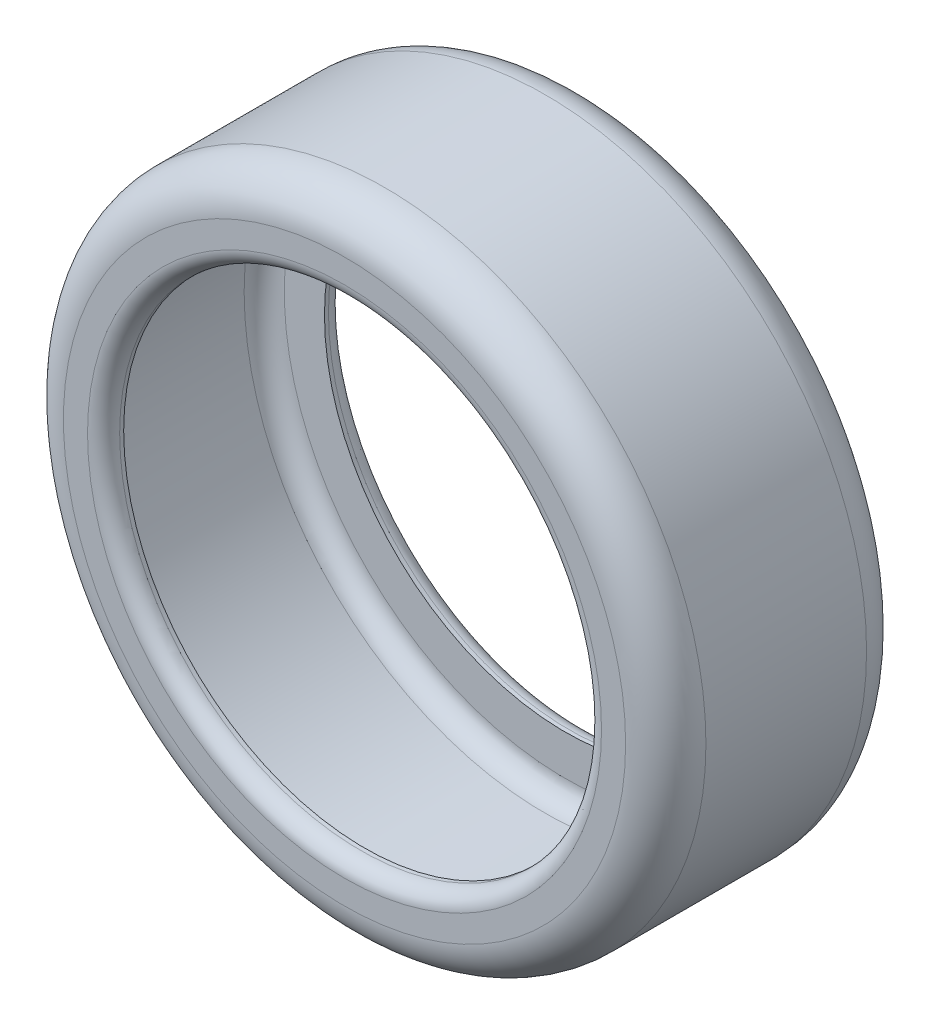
ISO-10303-21;
HEADER;
FILE_DESCRIPTION(('STEP AP214'),'2;1');
FILE_NAME('part.step','',(''),(''),'','','');
FILE_SCHEMA(('AUTOMOTIVE_DESIGN { 1 0 10303 214 1 1 1 1 }'));
ENDSEC;
DATA;
#1=APPLICATION_CONTEXT('core data for automotive mechanical design processes');
#2=APPLICATION_PROTOCOL_DEFINITION('international standard','automotive_design',2000,#1);
#3=PRODUCT_CONTEXT('',#1,'mechanical');
#4=PRODUCT('Part','Part','',(#3));
#5=PRODUCT_RELATED_PRODUCT_CATEGORY('part','',(#4));
#6=PRODUCT_DEFINITION_FORMATION('','',#4);
#7=PRODUCT_DEFINITION_CONTEXT('part definition',#1,'design');
#8=PRODUCT_DEFINITION('design','',#6,#7);
#9=PRODUCT_DEFINITION_SHAPE('','',#8);
#10=(LENGTH_UNIT() NAMED_UNIT(*) SI_UNIT(.MILLI.,.METRE.));
#11=(NAMED_UNIT(*) PLANE_ANGLE_UNIT() SI_UNIT($,.RADIAN.));
#12=(NAMED_UNIT(*) SI_UNIT($,.STERADIAN.) SOLID_ANGLE_UNIT());
#13=UNCERTAINTY_MEASURE_WITH_UNIT(LENGTH_MEASURE(1.E-05),#10,'distance_accuracy_value','');
#14=(GEOMETRIC_REPRESENTATION_CONTEXT(3) GLOBAL_UNCERTAINTY_ASSIGNED_CONTEXT((#13)) GLOBAL_UNIT_ASSIGNED_CONTEXT((#10,
#11,#12)) REPRESENTATION_CONTEXT('',''));
#15=CARTESIAN_POINT('',(0.,0.,0.));
#16=DIRECTION('',(0.,0.,1.));
#17=DIRECTION('',(1.,0.,0.));
#18=AXIS2_PLACEMENT_3D('',#15,#16,#17);
#19=CARTESIAN_POINT('',(0.,0.,76.2));
#20=DIRECTION('',(0.,0.,-1.));
#21=DIRECTION('',(-1.,0.,0.));
#22=AXIS2_PLACEMENT_3D('',#19,#20,#21);
#23=CYLINDRICAL_SURFACE('',#22,76.2);
#24=CARTESIAN_POINT('',(0.,0.,71.12));
#25=DIRECTION('',(0.,0.,1.));
#26=DIRECTION('',(1.,0.,0.));
#27=AXIS2_PLACEMENT_3D('',#24,#25,#26);
#28=CIRCLE('',#27,76.2);
#29=CARTESIAN_POINT('',(-76.2,0.,71.12));
#30=VERTEX_POINT('',#29);
#31=EDGE_CURVE('E62',#30,#30,#28,.T.);
#32=CARTESIAN_POINT('',(0.,0.,69.85));
#33=DIRECTION('',(0.,0.,1.));
#34=DIRECTION('',(1.,0.,0.));
#35=AXIS2_PLACEMENT_3D('',#32,#33,#34);
#36=CIRCLE('',#35,76.2);
#37=CARTESIAN_POINT('',(-76.2,0.,69.85));
#38=VERTEX_POINT('',#37);
#39=EDGE_CURVE('E86',#38,#38,#36,.F.);
#40=CARTESIAN_POINT('',(-76.2,0.,71.12));
#41=CARTESIAN_POINT('',(-76.2,0.,71.1067708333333));
#42=CARTESIAN_POINT('',(-76.2,0.,71.0935416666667));
#43=CARTESIAN_POINT('',(-76.2,0.,71.0670833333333));
#44=CARTESIAN_POINT('',(-76.2,0.,71.0538541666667));
#45=CARTESIAN_POINT('',(-76.2,0.,71.0273958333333));
#46=CARTESIAN_POINT('',(-76.2,0.,71.0141666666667));
#47=CARTESIAN_POINT('',(-76.2,0.,70.9877083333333));
#48=CARTESIAN_POINT('',(-76.2,0.,70.9744791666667));
#49=CARTESIAN_POINT('',(-76.2,0.,70.9480208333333));
#50=CARTESIAN_POINT('',(-76.2,0.,70.9347916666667));
#51=CARTESIAN_POINT('',(-76.2,0.,70.9083333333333));
#52=CARTESIAN_POINT('',(-76.2,0.,70.8951041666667));
#53=CARTESIAN_POINT('',(-76.2,0.,70.8686458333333));
#54=CARTESIAN_POINT('',(-76.2,0.,70.8554166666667));
#55=CARTESIAN_POINT('',(-76.2,0.,70.8289583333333));
#56=CARTESIAN_POINT('',(-76.2,0.,70.8157291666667));
#57=CARTESIAN_POINT('',(-76.2,0.,70.7892708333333));
#58=CARTESIAN_POINT('',(-76.2,0.,70.7760416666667));
#59=CARTESIAN_POINT('',(-76.2,0.,70.7495833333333));
#60=CARTESIAN_POINT('',(-76.2,0.,70.7363541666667));
#61=CARTESIAN_POINT('',(-76.2,0.,70.7098958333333));
#62=CARTESIAN_POINT('',(-76.2,0.,70.6966666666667));
#63=CARTESIAN_POINT('',(-76.2,0.,70.6702083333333));
#64=CARTESIAN_POINT('',(-76.2,0.,70.6569791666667));
#65=CARTESIAN_POINT('',(-76.2,0.,70.6305208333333));
#66=CARTESIAN_POINT('',(-76.2,0.,70.6172916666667));
#67=CARTESIAN_POINT('',(-76.2,0.,70.5908333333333));
#68=CARTESIAN_POINT('',(-76.2,0.,70.5776041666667));
#69=CARTESIAN_POINT('',(-76.2,0.,70.5511458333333));
#70=CARTESIAN_POINT('',(-76.2,0.,70.5379166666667));
#71=CARTESIAN_POINT('',(-76.2,0.,70.5114583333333));
#72=CARTESIAN_POINT('',(-76.2,0.,70.4982291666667));
#73=CARTESIAN_POINT('',(-76.2,0.,70.4717708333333));
#74=CARTESIAN_POINT('',(-76.2,0.,70.4585416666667));
#75=CARTESIAN_POINT('',(-76.2,0.,70.4320833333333));
#76=CARTESIAN_POINT('',(-76.2,0.,70.4188541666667));
#77=CARTESIAN_POINT('',(-76.2,0.,70.3923958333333));
#78=CARTESIAN_POINT('',(-76.2,0.,70.3791666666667));
#79=CARTESIAN_POINT('',(-76.2,0.,70.3527083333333));
#80=CARTESIAN_POINT('',(-76.2,0.,70.3394791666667));
#81=CARTESIAN_POINT('',(-76.2,0.,70.3130208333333));
#82=CARTESIAN_POINT('',(-76.2,0.,70.2997916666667));
#83=CARTESIAN_POINT('',(-76.2,0.,70.2733333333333));
#84=CARTESIAN_POINT('',(-76.2,0.,70.2601041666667));
#85=CARTESIAN_POINT('',(-76.2,0.,70.2336458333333));
#86=CARTESIAN_POINT('',(-76.2,0.,70.2204166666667));
#87=CARTESIAN_POINT('',(-76.2,0.,70.1939583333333));
#88=CARTESIAN_POINT('',(-76.2,0.,70.1807291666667));
#89=CARTESIAN_POINT('',(-76.2,0.,70.1542708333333));
#90=CARTESIAN_POINT('',(-76.2,0.,70.1410416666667));
#91=CARTESIAN_POINT('',(-76.2,0.,70.1145833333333));
#92=CARTESIAN_POINT('',(-76.2,0.,70.1013541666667));
#93=CARTESIAN_POINT('',(-76.2,0.,70.0748958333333));
#94=CARTESIAN_POINT('',(-76.2,0.,70.0616666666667));
#95=CARTESIAN_POINT('',(-76.2,0.,70.0352083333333));
#96=CARTESIAN_POINT('',(-76.2,0.,70.0219791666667));
#97=CARTESIAN_POINT('',(-76.2,0.,69.9955208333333));
#98=CARTESIAN_POINT('',(-76.2,0.,69.9822916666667));
#99=CARTESIAN_POINT('',(-76.2,0.,69.9558333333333));
#100=CARTESIAN_POINT('',(-76.2,0.,69.9426041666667));
#101=CARTESIAN_POINT('',(-76.2,0.,69.9161458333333));
#102=CARTESIAN_POINT('',(-76.2,0.,69.9029166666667));
#103=CARTESIAN_POINT('',(-76.2,0.,69.8764583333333));
#104=CARTESIAN_POINT('',(-76.2,0.,69.8632291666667));
#105=CARTESIAN_POINT('',(-76.2,0.,69.85));
#106=B_SPLINE_CURVE_WITH_KNOTS('',3,(#40,#41,#42,#43,#44,#45,#46,#47,#48,#49,#50,#51,#52,#53,
#54,#55,#56,#57,#58,#59,#60,#61,#62,#63,#64,#65,#66,#67,#68,#69,#70,#71,#72,#73,#74,#75,#76,#77,
#78,#79,#80,#81,#82,#83,#84,#85,#86,#87,#88,#89,#90,#91,#92,#93,#94,#95,#96,#97,#98,#99,#100,
#101,#102,#103,#104,#105),.UNSPECIFIED.,.F.,.F.,(4,2,2,2,2,2,2,2,2,2,2,2,2,2,2,2,2,2,2,2,2,2,2,
2,2,2,2,2,2,2,2,2,4),(0.,0.0396875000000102,0.0793750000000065,0.119062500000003,
0.158749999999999,0.198437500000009,0.238125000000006,0.277812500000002,0.317499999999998,
0.357187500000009,0.396875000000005,0.436562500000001,0.476249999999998,0.515937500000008,
0.555625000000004,0.5953125,0.634999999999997,0.674687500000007,0.714375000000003,0.7540625,
0.793749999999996,0.833437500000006,0.873125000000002,0.912812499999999,0.952499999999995,
0.992187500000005,1.031875,1.0715625,1.11124999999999,1.1509375,1.190625,1.2303125,
1.26999999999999),.UNSPECIFIED.);
#107=EDGE_CURVE('BSEAM51',#30,#38,#106,.T.);
#108=ORIENTED_EDGE('',*,*,#31,.T.);
#109=ORIENTED_EDGE('',*,*,#39,.T.);
#110=ORIENTED_EDGE('',*,*,#107,.T.);
#111=ORIENTED_EDGE('',*,*,#107,.F.);
#112=EDGE_LOOP('',(#108,#110,#109,#111));
#113=FACE_BOUND('',#112,.T.);
#114=ADVANCED_FACE('F51',(#113),#23,.F.);
#115=CARTESIAN_POINT('',(0.,0.,76.2));
#116=DIRECTION('',(0.,0.,1.));
#117=DIRECTION('',(1.,0.,0.));
#118=AXIS2_PLACEMENT_3D('',#115,#116,#117);
#119=PLANE('',#118);
#120=CARTESIAN_POINT('',(0.,0.,76.2));
#121=DIRECTION('',(0.,0.,1.));
#122=DIRECTION('',(1.,0.,0.));
#123=AXIS2_PLACEMENT_3D('',#120,#121,#122);
#124=CIRCLE('',#123,81.28);
#125=CARTESIAN_POINT('',(81.28,0.,76.2));
#126=VERTEX_POINT('',#125);
#127=EDGE_CURVE('E10',#126,#126,#124,.F.);
#128=ORIENTED_EDGE('',*,*,#127,.T.);
#129=EDGE_LOOP('',(#128));
#130=FACE_BOUND('',#129,.T.);
#131=CARTESIAN_POINT('',(0.,0.,76.2));
#132=DIRECTION('',(0.,0.,1.));
#133=DIRECTION('',(1.,0.,0.));
#134=AXIS2_PLACEMENT_3D('',#131,#132,#133);
#135=CIRCLE('',#134,88.9);
#136=CARTESIAN_POINT('',(88.9,0.,76.2));
#137=VERTEX_POINT('',#136);
#138=EDGE_CURVE('E71',#137,#137,#135,.T.);
#139=ORIENTED_EDGE('',*,*,#138,.T.);
#140=EDGE_LOOP('',(#139));
#141=FACE_BOUND('',#140,.T.);
#142=ADVANCED_FACE('F112',(#130,#141),#119,.T.);
#143=CARTESIAN_POINT('',(0.,0.,0.));
#144=DIRECTION('',(0.,0.,1.));
#145=DIRECTION('',(1.,0.,0.));
#146=AXIS2_PLACEMENT_3D('',#143,#144,#145);
#147=PLANE('',#146);
#148=CARTESIAN_POINT('',(0.,0.,0.));
#149=DIRECTION('',(0.,0.,1.));
#150=DIRECTION('',(1.,0.,0.));
#151=AXIS2_PLACEMENT_3D('',#148,#149,#150);
#152=CIRCLE('',#151,81.28);
#153=CARTESIAN_POINT('',(81.28,0.,0.));
#154=VERTEX_POINT('',#153);
#155=EDGE_CURVE('E66',#154,#154,#152,.T.);
#156=ORIENTED_EDGE('',*,*,#155,.T.);
#157=EDGE_LOOP('',(#156));
#158=FACE_BOUND('',#157,.T.);
#159=CARTESIAN_POINT('',(0.,0.,0.));
#160=DIRECTION('',(0.,0.,1.));
#161=DIRECTION('',(1.,0.,0.));
#162=AXIS2_PLACEMENT_3D('',#159,#160,#161);
#163=CIRCLE('',#162,88.9);
#164=CARTESIAN_POINT('',(88.9,0.,0.));
#165=VERTEX_POINT('',#164);
#166=EDGE_CURVE('E74',#165,#165,#163,.F.);
#167=ORIENTED_EDGE('',*,*,#166,.T.);
#168=EDGE_LOOP('',(#167));
#169=FACE_BOUND('',#168,.T.);
#170=ADVANCED_FACE('F121',(#158,#169),#147,.F.);
#171=CARTESIAN_POINT('',(0.,0.,76.2));
#172=DIRECTION('',(0.,0.,-1.));
#173=DIRECTION('',(-1.,0.,0.));
#174=AXIS2_PLACEMENT_3D('',#171,#172,#173);
#175=CYLINDRICAL_SURFACE('',#174,101.6);
#176=CARTESIAN_POINT('',(0.,0.,12.7));
#177=DIRECTION('',(0.,0.,1.));
#178=DIRECTION('',(1.,0.,0.));
#179=AXIS2_PLACEMENT_3D('',#176,#177,#178);
#180=CIRCLE('',#179,101.6);
#181=CARTESIAN_POINT('',(-101.6,0.,12.7));
#182=VERTEX_POINT('',#181);
#183=EDGE_CURVE('E77',#182,#182,#180,.T.);
#184=CARTESIAN_POINT('',(0.,0.,63.5));
#185=DIRECTION('',(0.,0.,1.));
#186=DIRECTION('',(1.,0.,0.));
#187=AXIS2_PLACEMENT_3D('',#184,#185,#186);
#188=CIRCLE('',#187,101.6);
#189=CARTESIAN_POINT('',(-101.6,0.,63.5));
#190=VERTEX_POINT('',#189);
#191=EDGE_CURVE('E80',#190,#190,#188,.F.);
#192=CARTESIAN_POINT('',(-101.6,0.,12.7));
#193=CARTESIAN_POINT('',(-101.6,0.,13.2291666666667));
#194=CARTESIAN_POINT('',(-101.6,0.,13.7583333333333));
#195=CARTESIAN_POINT('',(-101.6,0.,14.8166666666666));
#196=CARTESIAN_POINT('',(-101.6,0.,15.3458333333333));
#197=CARTESIAN_POINT('',(-101.6,0.,16.4041666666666));
#198=CARTESIAN_POINT('',(-101.6,0.,16.9333333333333));
#199=CARTESIAN_POINT('',(-101.6,0.,17.9916666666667));
#200=CARTESIAN_POINT('',(-101.6,0.,18.5208333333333));
#201=CARTESIAN_POINT('',(-101.6,0.,19.5791666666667));
#202=CARTESIAN_POINT('',(-101.6,0.,20.1083333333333));
#203=CARTESIAN_POINT('',(-101.6,0.,21.1666666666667));
#204=CARTESIAN_POINT('',(-101.6,0.,21.6958333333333));
#205=CARTESIAN_POINT('',(-101.6,0.,22.7541666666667));
#206=CARTESIAN_POINT('',(-101.6,0.,23.2833333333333));
#207=CARTESIAN_POINT('',(-101.6,0.,24.3416666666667));
#208=CARTESIAN_POINT('',(-101.6,0.,24.8708333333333));
#209=CARTESIAN_POINT('',(-101.6,0.,25.9291666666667));
#210=CARTESIAN_POINT('',(-101.6,0.,26.4583333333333));
#211=CARTESIAN_POINT('',(-101.6,0.,27.5166666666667));
#212=CARTESIAN_POINT('',(-101.6,0.,28.0458333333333));
#213=CARTESIAN_POINT('',(-101.6,0.,29.1041666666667));
#214=CARTESIAN_POINT('',(-101.6,0.,29.6333333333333));
#215=CARTESIAN_POINT('',(-101.6,0.,30.6916666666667));
#216=CARTESIAN_POINT('',(-101.6,0.,31.2208333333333));
#217=CARTESIAN_POINT('',(-101.6,0.,32.2791666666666));
#218=CARTESIAN_POINT('',(-101.6,0.,32.8083333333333));
#219=CARTESIAN_POINT('',(-101.6,0.,33.8666666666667));
#220=CARTESIAN_POINT('',(-101.6,0.,34.3958333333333));
#221=CARTESIAN_POINT('',(-101.6,0.,35.4541666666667));
#222=CARTESIAN_POINT('',(-101.6,0.,35.9833333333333));
#223=CARTESIAN_POINT('',(-101.6,0.,37.0416666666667));
#224=CARTESIAN_POINT('',(-101.6,0.,37.5708333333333));
#225=CARTESIAN_POINT('',(-101.6,0.,38.6291666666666));
#226=CARTESIAN_POINT('',(-101.6,0.,39.1583333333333));
#227=CARTESIAN_POINT('',(-101.6,0.,40.2166666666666));
#228=CARTESIAN_POINT('',(-101.6,0.,40.7458333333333));
#229=CARTESIAN_POINT('',(-101.6,0.,41.8041666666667));
#230=CARTESIAN_POINT('',(-101.6,0.,42.3333333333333));
#231=CARTESIAN_POINT('',(-101.6,0.,43.3916666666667));
#232=CARTESIAN_POINT('',(-101.6,0.,43.9208333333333));
#233=CARTESIAN_POINT('',(-101.6,0.,44.9791666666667));
#234=CARTESIAN_POINT('',(-101.6,0.,45.5083333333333));
#235=CARTESIAN_POINT('',(-101.6,0.,46.5666666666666));
#236=CARTESIAN_POINT('',(-101.6,0.,47.0958333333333));
#237=CARTESIAN_POINT('',(-101.6,0.,48.1541666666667));
#238=CARTESIAN_POINT('',(-101.6,0.,48.6833333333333));
#239=CARTESIAN_POINT('',(-101.6,0.,49.7416666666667));
#240=CARTESIAN_POINT('',(-101.6,0.,50.2708333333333));
#241=CARTESIAN_POINT('',(-101.6,0.,51.3291666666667));
#242=CARTESIAN_POINT('',(-101.6,0.,51.8583333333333));
#243=CARTESIAN_POINT('',(-101.6,0.,52.9166666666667));
#244=CARTESIAN_POINT('',(-101.6,0.,53.4458333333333));
#245=CARTESIAN_POINT('',(-101.6,0.,54.5041666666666));
#246=CARTESIAN_POINT('',(-101.6,0.,55.0333333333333));
#247=CARTESIAN_POINT('',(-101.6,0.,56.0916666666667));
#248=CARTESIAN_POINT('',(-101.6,0.,56.6208333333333));
#249=CARTESIAN_POINT('',(-101.6,0.,57.6791666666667));
#250=CARTESIAN_POINT('',(-101.6,0.,58.2083333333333));
#251=CARTESIAN_POINT('',(-101.6,0.,59.2666666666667));
#252=CARTESIAN_POINT('',(-101.6,0.,59.7958333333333));
#253=CARTESIAN_POINT('',(-101.6,0.,60.8541666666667));
#254=CARTESIAN_POINT('',(-101.6,0.,61.3833333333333));
#255=CARTESIAN_POINT('',(-101.6,0.,62.4416666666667));
#256=CARTESIAN_POINT('',(-101.6,0.,62.9708333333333));
#257=CARTESIAN_POINT('',(-101.6,0.,63.5));
#258=B_SPLINE_CURVE_WITH_KNOTS('',3,(#192,#193,#194,#195,#196,#197,#198,#199,#200,#201,#202,
#203,#204,#205,#206,#207,#208,#209,#210,#211,#212,#213,#214,#215,#216,#217,#218,#219,#220,#221,
#222,#223,#224,#225,#226,#227,#228,#229,#230,#231,#232,#233,#234,#235,#236,#237,#238,#239,#240,
#241,#242,#243,#244,#245,#246,#247,#248,#249,#250,#251,#252,#253,#254,#255,#256,#257),
.UNSPECIFIED.,.F.,.F.,(4,2,2,2,2,2,2,2,2,2,2,2,2,2,2,2,2,2,2,2,2,2,2,2,2,2,2,2,2,2,2,2,4),(0.,
1.58749999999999,3.17499999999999,4.7625,6.34999999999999,7.93749999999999,9.525,11.1125,12.7,
14.2875,15.875,17.4625,19.05,20.6375,22.225,23.8125,25.4,26.9875,28.575,30.1625,31.75,33.3375,
34.925,36.5125,38.1,39.6875,41.275,42.8625,44.45,46.0375,47.625,49.2125,50.8),.UNSPECIFIED.);
#259=EDGE_CURVE('BSEAM125',#182,#190,#258,.T.);
#260=ORIENTED_EDGE('',*,*,#183,.T.);
#261=ORIENTED_EDGE('',*,*,#191,.T.);
#262=ORIENTED_EDGE('',*,*,#259,.T.);
#263=ORIENTED_EDGE('',*,*,#259,.F.);
#264=EDGE_LOOP('',(#260,#262,#261,#263));
#265=FACE_BOUND('',#264,.T.);
#266=ADVANCED_FACE('F125',(#265),#175,.T.);
#267=CARTESIAN_POINT('',(0.,0.,6.34999999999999));
#268=DIRECTION('',(0.,0.,1.));
#269=DIRECTION('',(1.,0.,0.));
#270=AXIS2_PLACEMENT_3D('',#267,#268,#269);
#271=CIRCLE('',#270,76.2);
#272=CARTESIAN_POINT('',(-76.2,0.,6.34999999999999));
#273=VERTEX_POINT('',#272);
#274=EDGE_CURVE('E83',#273,#273,#271,.F.);
#275=CARTESIAN_POINT('',(0.,0.,5.08));
#276=DIRECTION('',(0.,0.,1.));
#277=DIRECTION('',(1.,0.,0.));
#278=AXIS2_PLACEMENT_3D('',#275,#276,#277);
#279=CIRCLE('',#278,76.2);
#280=CARTESIAN_POINT('',(-76.2,0.,5.08));
#281=VERTEX_POINT('',#280);
#282=EDGE_CURVE('E58',#281,#281,#279,.F.);
#283=CARTESIAN_POINT('',(-76.2,0.,6.34999999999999));
#284=CARTESIAN_POINT('',(-76.2,0.,6.33677083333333));
#285=CARTESIAN_POINT('',(-76.2,0.,6.32354166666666));
#286=CARTESIAN_POINT('',(-76.2,0.,6.29708333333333));
#287=CARTESIAN_POINT('',(-76.2,0.,6.28385416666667));
#288=CARTESIAN_POINT('',(-76.2,0.,6.25739583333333));
#289=CARTESIAN_POINT('',(-76.2,0.,6.24416666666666));
#290=CARTESIAN_POINT('',(-76.2,0.,6.21770833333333));
#291=CARTESIAN_POINT('',(-76.2,0.,6.20447916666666));
#292=CARTESIAN_POINT('',(-76.2,0.,6.17802083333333));
#293=CARTESIAN_POINT('',(-76.2,0.,6.16479166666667));
#294=CARTESIAN_POINT('',(-76.2,0.,6.13833333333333));
#295=CARTESIAN_POINT('',(-76.2,0.,6.12510416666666));
#296=CARTESIAN_POINT('',(-76.2,0.,6.09864583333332));
#297=CARTESIAN_POINT('',(-76.2,0.,6.08541666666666));
#298=CARTESIAN_POINT('',(-76.2,0.,6.05895833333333));
#299=CARTESIAN_POINT('',(-76.2,0.,6.04572916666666));
#300=CARTESIAN_POINT('',(-76.2,0.,6.01927083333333));
#301=CARTESIAN_POINT('',(-76.2,0.,6.00604166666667));
#302=CARTESIAN_POINT('',(-76.2,0.,5.97958333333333));
#303=CARTESIAN_POINT('',(-76.2,0.,5.96635416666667));
#304=CARTESIAN_POINT('',(-76.2,0.,5.93989583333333));
#305=CARTESIAN_POINT('',(-76.2,0.,5.92666666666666));
#306=CARTESIAN_POINT('',(-76.2,0.,5.90020833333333));
#307=CARTESIAN_POINT('',(-76.2,0.,5.88697916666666));
#308=CARTESIAN_POINT('',(-76.2,0.,5.86052083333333));
#309=CARTESIAN_POINT('',(-76.2,0.,5.84729166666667));
#310=CARTESIAN_POINT('',(-76.2,0.,5.82083333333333));
#311=CARTESIAN_POINT('',(-76.2,0.,5.80760416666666));
#312=CARTESIAN_POINT('',(-76.2,0.,5.78114583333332));
#313=CARTESIAN_POINT('',(-76.2,0.,5.76791666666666));
#314=CARTESIAN_POINT('',(-76.2,0.,5.74145833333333));
#315=CARTESIAN_POINT('',(-76.2,0.,5.72822916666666));
#316=CARTESIAN_POINT('',(-76.2,0.,5.70177083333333));
#317=CARTESIAN_POINT('',(-76.2,0.,5.68854166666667));
#318=CARTESIAN_POINT('',(-76.2,0.,5.66208333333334));
#319=CARTESIAN_POINT('',(-76.2,0.,5.64885416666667));
#320=CARTESIAN_POINT('',(-76.2,0.,5.62239583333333));
#321=CARTESIAN_POINT('',(-76.2,0.,5.60916666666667));
#322=CARTESIAN_POINT('',(-76.2,0.,5.58270833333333));
#323=CARTESIAN_POINT('',(-76.2,0.,5.56947916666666));
#324=CARTESIAN_POINT('',(-76.2,0.,5.54302083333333));
#325=CARTESIAN_POINT('',(-76.2,0.,5.52979166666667));
#326=CARTESIAN_POINT('',(-76.2,0.,5.50333333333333));
#327=CARTESIAN_POINT('',(-76.2,0.,5.49010416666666));
#328=CARTESIAN_POINT('',(-76.2,0.,5.46364583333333));
#329=CARTESIAN_POINT('',(-76.2,0.,5.45041666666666));
#330=CARTESIAN_POINT('',(-76.2,0.,5.42395833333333));
#331=CARTESIAN_POINT('',(-76.2,0.,5.41072916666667));
#332=CARTESIAN_POINT('',(-76.2,0.,5.38427083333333));
#333=CARTESIAN_POINT('',(-76.2,0.,5.37104166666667));
#334=CARTESIAN_POINT('',(-76.2,0.,5.34458333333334));
#335=CARTESIAN_POINT('',(-76.2,0.,5.33135416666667));
#336=CARTESIAN_POINT('',(-76.2,0.,5.30489583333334));
#337=CARTESIAN_POINT('',(-76.2,0.,5.29166666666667));
#338=CARTESIAN_POINT('',(-76.2,0.,5.26520833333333));
#339=CARTESIAN_POINT('',(-76.2,0.,5.25197916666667));
#340=CARTESIAN_POINT('',(-76.2,0.,5.22552083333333));
#341=CARTESIAN_POINT('',(-76.2,0.,5.21229166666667));
#342=CARTESIAN_POINT('',(-76.2,0.,5.18583333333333));
#343=CARTESIAN_POINT('',(-76.2,0.,5.17260416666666));
#344=CARTESIAN_POINT('',(-76.2,0.,5.14614583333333));
#345=CARTESIAN_POINT('',(-76.2,0.,5.13291666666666));
#346=CARTESIAN_POINT('',(-76.2,0.,5.10645833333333));
#347=CARTESIAN_POINT('',(-76.2,0.,5.09322916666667));
#348=CARTESIAN_POINT('',(-76.2,0.,5.08));
#349=B_SPLINE_CURVE_WITH_KNOTS('',3,(#283,#284,#285,#286,#287,#288,#289,#290,#291,#292,#293,
#294,#295,#296,#297,#298,#299,#300,#301,#302,#303,#304,#305,#306,#307,#308,#309,#310,#311,#312,
#313,#314,#315,#316,#317,#318,#319,#320,#321,#322,#323,#324,#325,#326,#327,#328,#329,#330,#331,
#332,#333,#334,#335,#336,#337,#338,#339,#340,#341,#342,#343,#344,#345,#346,#347,#348),
.UNSPECIFIED.,.F.,.F.,(4,2,2,2,2,2,2,2,2,2,2,2,2,2,2,2,2,2,2,2,2,2,2,2,2,2,2,2,2,2,2,2,4),(0.,
0.0396874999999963,0.0793749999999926,0.119062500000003,0.158749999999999,0.198437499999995,
0.238125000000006,0.277812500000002,0.317499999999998,0.357187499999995,0.396874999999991,
0.436562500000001,0.476249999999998,0.515937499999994,0.555625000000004,0.5953125,
0.634999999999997,0.674687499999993,0.714374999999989,0.7540625,0.793749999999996,
0.833437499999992,0.873125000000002,0.912812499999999,0.952499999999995,0.992187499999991,
1.03187499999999,1.0715625,1.11124999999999,1.15093749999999,1.190625,1.2303125,
1.26999999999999),.UNSPECIFIED.);
#350=EDGE_CURVE('BSEAM115',#273,#281,#349,.T.);
#351=ORIENTED_EDGE('',*,*,#274,.F.);
#352=ORIENTED_EDGE('',*,*,#282,.T.);
#353=ORIENTED_EDGE('',*,*,#350,.T.);
#354=ORIENTED_EDGE('',*,*,#350,.F.);
#355=EDGE_LOOP('',(#351,#353,#352,#354));
#356=FACE_BOUND('',#355,.T.);
#357=ADVANCED_FACE('F115',(#356),#23,.F.);
#358=CARTESIAN_POINT('',(0.,0.,12.7));
#359=DIRECTION('',(0.,0.,1.));
#360=DIRECTION('',(1.,0.,0.));
#361=AXIS2_PLACEMENT_3D('',#358,#359,#360);
#362=TOROIDAL_SURFACE('',#361,88.9,12.7);
#363=ORIENTED_EDGE('',*,*,#166,.F.);
#364=EDGE_LOOP('',(#363));
#365=FACE_BOUND('',#364,.T.);
#366=ORIENTED_EDGE('',*,*,#183,.F.);
#367=EDGE_LOOP('',(#366));
#368=FACE_BOUND('',#367,.T.);
#369=ADVANCED_FACE('F124',(#365,#368),#362,.T.);
#370=CARTESIAN_POINT('',(0.,0.,63.5));
#371=DIRECTION('',(0.,0.,1.));
#372=DIRECTION('',(1.,0.,0.));
#373=AXIS2_PLACEMENT_3D('',#370,#371,#372);
#374=TOROIDAL_SURFACE('',#373,88.9,12.7);
#375=ORIENTED_EDGE('',*,*,#191,.F.);
#376=EDGE_LOOP('',(#375));
#377=FACE_BOUND('',#376,.T.);
#378=ORIENTED_EDGE('',*,*,#138,.F.);
#379=EDGE_LOOP('',(#378));
#380=FACE_BOUND('',#379,.T.);
#381=ADVANCED_FACE('F130',(#377,#380),#374,.T.);
#382=CARTESIAN_POINT('',(0.,0.,5.08));
#383=DIRECTION('',(0.,0.,1.));
#384=DIRECTION('',(1.,0.,0.));
#385=AXIS2_PLACEMENT_3D('',#382,#383,#384);
#386=TOROIDAL_SURFACE('',#385,81.28,5.08);
#387=ORIENTED_EDGE('',*,*,#282,.F.);
#388=EDGE_LOOP('',(#387));
#389=FACE_BOUND('',#388,.T.);
#390=ORIENTED_EDGE('',*,*,#155,.F.);
#391=EDGE_LOOP('',(#390));
#392=FACE_BOUND('',#391,.T.);
#393=ADVANCED_FACE('F200',(#389,#392),#386,.T.);
#394=CARTESIAN_POINT('',(0.,0.,71.12));
#395=DIRECTION('',(0.,0.,1.));
#396=DIRECTION('',(1.,0.,0.));
#397=AXIS2_PLACEMENT_3D('',#394,#395,#396);
#398=TOROIDAL_SURFACE('',#397,81.28,5.08);
#399=ORIENTED_EDGE('',*,*,#127,.F.);
#400=EDGE_LOOP('',(#399));
#401=FACE_BOUND('',#400,.T.);
#402=ORIENTED_EDGE('',*,*,#31,.F.);
#403=EDGE_LOOP('',(#402));
#404=FACE_BOUND('',#403,.T.);
#405=ADVANCED_FACE('F53',(#401,#404),#398,.T.);
#406=CARTESIAN_POINT('',(0.,0.,69.85));
#407=DIRECTION('',(0.,0.,1.));
#408=DIRECTION('',(1.,0.,0.));
#409=AXIS2_PLACEMENT_3D('',#406,#407,#408);
#410=PLANE('',#409);
#411=CARTESIAN_POINT('',(0.,0.,69.85));
#412=DIRECTION('',(0.,0.,1.));
#413=DIRECTION('',(1.,0.,0.));
#414=AXIS2_PLACEMENT_3D('',#411,#412,#413);
#415=CIRCLE('',#414,88.9);
#416=CARTESIAN_POINT('',(88.9,0.,69.85));
#417=VERTEX_POINT('',#416);
#418=EDGE_CURVE('E89',#417,#417,#415,.T.);
#419=ORIENTED_EDGE('',*,*,#418,.F.);
#420=EDGE_LOOP('',(#419));
#421=FACE_BOUND('',#420,.T.);
#422=ORIENTED_EDGE('',*,*,#39,.F.);
#423=EDGE_LOOP('',(#422));
#424=FACE_BOUND('',#423,.T.);
#425=ADVANCED_FACE('F104',(#421,#424),#410,.F.);
#426=CARTESIAN_POINT('',(0.,0.,6.35));
#427=DIRECTION('',(0.,0.,1.));
#428=DIRECTION('',(1.,0.,0.));
#429=AXIS2_PLACEMENT_3D('',#426,#427,#428);
#430=PLANE('',#429);
#431=CARTESIAN_POINT('',(0.,0.,6.35));
#432=DIRECTION('',(0.,0.,1.));
#433=DIRECTION('',(1.,0.,0.));
#434=AXIS2_PLACEMENT_3D('',#431,#432,#433);
#435=CIRCLE('',#434,88.9);
#436=CARTESIAN_POINT('',(88.9,0.,6.35));
#437=VERTEX_POINT('',#436);
#438=EDGE_CURVE('E90',#437,#437,#435,.F.);
#439=ORIENTED_EDGE('',*,*,#438,.F.);
#440=EDGE_LOOP('',(#439));
#441=FACE_BOUND('',#440,.T.);
#442=ORIENTED_EDGE('',*,*,#274,.T.);
#443=EDGE_LOOP('',(#442));
#444=FACE_BOUND('',#443,.T.);
#445=ADVANCED_FACE('F107',(#441,#444),#430,.T.);
#446=CARTESIAN_POINT('',(0.,0.,76.2));
#447=DIRECTION('',(0.,0.,-1.));
#448=DIRECTION('',(-1.,0.,0.));
#449=AXIS2_PLACEMENT_3D('',#446,#447,#448);
#450=CYLINDRICAL_SURFACE('',#449,95.25);
#451=CARTESIAN_POINT('',(0.,0.,12.7));
#452=DIRECTION('',(0.,0.,-1.));
#453=DIRECTION('',(-1.,0.,0.));
#454=AXIS2_PLACEMENT_3D('',#451,#452,#453);
#455=CIRCLE('',#454,95.25);
#456=CARTESIAN_POINT('',(-95.25,0.,12.7));
#457=VERTEX_POINT('',#456);
#458=EDGE_CURVE('E93',#457,#457,#455,.F.);
#459=CARTESIAN_POINT('',(0.,0.,63.5));
#460=DIRECTION('',(0.,0.,-1.));
#461=DIRECTION('',(-1.,0.,0.));
#462=AXIS2_PLACEMENT_3D('',#459,#460,#461);
#463=CIRCLE('',#462,95.25);
#464=CARTESIAN_POINT('',(-95.25,0.,63.5));
#465=VERTEX_POINT('',#464);
#466=EDGE_CURVE('E96',#465,#465,#463,.T.);
#467=CARTESIAN_POINT('',(-95.25,0.,12.7));
#468=CARTESIAN_POINT('',(-95.25,0.,13.2291666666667));
#469=CARTESIAN_POINT('',(-95.25,0.,13.7583333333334));
#470=CARTESIAN_POINT('',(-95.25,0.,14.8166666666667));
#471=CARTESIAN_POINT('',(-95.25,0.,15.3458333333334));
#472=CARTESIAN_POINT('',(-95.25,0.,16.4041666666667));
#473=CARTESIAN_POINT('',(-95.25,0.,16.9333333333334));
#474=CARTESIAN_POINT('',(-95.25,0.,17.9916666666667));
#475=CARTESIAN_POINT('',(-95.25,0.,18.5208333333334));
#476=CARTESIAN_POINT('',(-95.25,0.,19.5791666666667));
#477=CARTESIAN_POINT('',(-95.25,0.,20.1083333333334));
#478=CARTESIAN_POINT('',(-95.25,0.,21.1666666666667));
#479=CARTESIAN_POINT('',(-95.25,0.,21.6958333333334));
#480=CARTESIAN_POINT('',(-95.25,0.,22.7541666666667));
#481=CARTESIAN_POINT('',(-95.25,0.,23.2833333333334));
#482=CARTESIAN_POINT('',(-95.25,0.,24.3416666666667));
#483=CARTESIAN_POINT('',(-95.25,0.,24.8708333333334));
#484=CARTESIAN_POINT('',(-95.25,0.,25.9291666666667));
#485=CARTESIAN_POINT('',(-95.25,0.,26.4583333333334));
#486=CARTESIAN_POINT('',(-95.25,0.,27.5166666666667));
#487=CARTESIAN_POINT('',(-95.25,0.,28.0458333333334));
#488=CARTESIAN_POINT('',(-95.25,0.,29.1041666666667));
#489=CARTESIAN_POINT('',(-95.25,0.,29.6333333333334));
#490=CARTESIAN_POINT('',(-95.25,0.,30.6916666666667));
#491=CARTESIAN_POINT('',(-95.25,0.,31.2208333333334));
#492=CARTESIAN_POINT('',(-95.25,0.,32.2791666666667));
#493=CARTESIAN_POINT('',(-95.25,0.,32.8083333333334));
#494=CARTESIAN_POINT('',(-95.25,0.,33.8666666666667));
#495=CARTESIAN_POINT('',(-95.25,0.,34.3958333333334));
#496=CARTESIAN_POINT('',(-95.25,0.,35.4541666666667));
#497=CARTESIAN_POINT('',(-95.25,0.,35.9833333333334));
#498=CARTESIAN_POINT('',(-95.25,0.,37.0416666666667));
#499=CARTESIAN_POINT('',(-95.25,0.,37.5708333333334));
#500=CARTESIAN_POINT('',(-95.25,0.,38.6291666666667));
#501=CARTESIAN_POINT('',(-95.25,0.,39.1583333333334));
#502=CARTESIAN_POINT('',(-95.25,0.,40.2166666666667));
#503=CARTESIAN_POINT('',(-95.25,0.,40.7458333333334));
#504=CARTESIAN_POINT('',(-95.25,0.,41.8041666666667));
#505=CARTESIAN_POINT('',(-95.25,0.,42.3333333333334));
#506=CARTESIAN_POINT('',(-95.25,0.,43.3916666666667));
#507=CARTESIAN_POINT('',(-95.25,0.,43.9208333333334));
#508=CARTESIAN_POINT('',(-95.25,0.,44.9791666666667));
#509=CARTESIAN_POINT('',(-95.25,0.,45.5083333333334));
#510=CARTESIAN_POINT('',(-95.25,0.,46.5666666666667));
#511=CARTESIAN_POINT('',(-95.25,0.,47.0958333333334));
#512=CARTESIAN_POINT('',(-95.25,0.,48.1541666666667));
#513=CARTESIAN_POINT('',(-95.25,0.,48.6833333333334));
#514=CARTESIAN_POINT('',(-95.25,0.,49.7416666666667));
#515=CARTESIAN_POINT('',(-95.25,0.,50.2708333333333));
#516=CARTESIAN_POINT('',(-95.25,0.,51.3291666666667));
#517=CARTESIAN_POINT('',(-95.25,0.,51.8583333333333));
#518=CARTESIAN_POINT('',(-95.25,0.,52.9166666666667));
#519=CARTESIAN_POINT('',(-95.25,0.,53.4458333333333));
#520=CARTESIAN_POINT('',(-95.25,0.,54.5041666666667));
#521=CARTESIAN_POINT('',(-95.25,0.,55.0333333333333));
#522=CARTESIAN_POINT('',(-95.25,0.,56.0916666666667));
#523=CARTESIAN_POINT('',(-95.25,0.,56.6208333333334));
#524=CARTESIAN_POINT('',(-95.25,0.,57.6791666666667));
#525=CARTESIAN_POINT('',(-95.25,0.,58.2083333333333));
#526=CARTESIAN_POINT('',(-95.25,0.,59.2666666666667));
#527=CARTESIAN_POINT('',(-95.25,0.,59.7958333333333));
#528=CARTESIAN_POINT('',(-95.25,0.,60.8541666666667));
#529=CARTESIAN_POINT('',(-95.25,0.,61.3833333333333));
#530=CARTESIAN_POINT('',(-95.25,0.,62.4416666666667));
#531=CARTESIAN_POINT('',(-95.25,0.,62.9708333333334));
#532=CARTESIAN_POINT('',(-95.25,0.,63.5));
#533=B_SPLINE_CURVE_WITH_KNOTS('',3,(#467,#468,#469,#470,#471,#472,#473,#474,#475,#476,#477,
#478,#479,#480,#481,#482,#483,#484,#485,#486,#487,#488,#489,#490,#491,#492,#493,#494,#495,#496,
#497,#498,#499,#500,#501,#502,#503,#504,#505,#506,#507,#508,#509,#510,#511,#512,#513,#514,#515,
#516,#517,#518,#519,#520,#521,#522,#523,#524,#525,#526,#527,#528,#529,#530,#531,#532),
.UNSPECIFIED.,.F.,.F.,(4,2,2,2,2,2,2,2,2,2,2,2,2,2,2,2,2,2,2,2,2,2,2,2,2,2,2,2,2,2,2,2,4),(0.,
1.58749999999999,3.17499999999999,4.76249999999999,6.34999999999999,7.93749999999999,
9.52499999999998,11.1125,12.7,14.2875,15.875,17.4625,19.05,20.6375,22.225,23.8125,25.4,26.9875,
28.575,30.1625,31.75,33.3375,34.925,36.5125,38.1,39.6875,41.275,42.8625,44.45,46.0375,47.625,
49.2125,50.8),.UNSPECIFIED.);
#534=EDGE_CURVE('BSEAM139',#457,#465,#533,.T.);
#535=ORIENTED_EDGE('',*,*,#458,.F.);
#536=ORIENTED_EDGE('',*,*,#466,.F.);
#537=ORIENTED_EDGE('',*,*,#534,.T.);
#538=ORIENTED_EDGE('',*,*,#534,.F.);
#539=EDGE_LOOP('',(#535,#537,#536,#538));
#540=FACE_BOUND('',#539,.T.);
#541=ADVANCED_FACE('F139',(#540),#450,.F.);
#542=CARTESIAN_POINT('',(0.,0.,12.7));
#543=DIRECTION('',(0.,0.,1.));
#544=DIRECTION('',(1.,0.,0.));
#545=AXIS2_PLACEMENT_3D('',#542,#543,#544);
#546=TOROIDAL_SURFACE('',#545,88.9,6.35);
#547=ORIENTED_EDGE('',*,*,#438,.T.);
#548=EDGE_LOOP('',(#547));
#549=FACE_BOUND('',#548,.T.);
#550=ORIENTED_EDGE('',*,*,#458,.T.);
#551=EDGE_LOOP('',(#550));
#552=FACE_BOUND('',#551,.T.);
#553=ADVANCED_FACE('F146',(#549,#552),#546,.F.);
#554=CARTESIAN_POINT('',(0.,0.,63.5));
#555=DIRECTION('',(0.,0.,1.));
#556=DIRECTION('',(1.,0.,0.));
#557=AXIS2_PLACEMENT_3D('',#554,#555,#556);
#558=TOROIDAL_SURFACE('',#557,88.9,6.35);
#559=ORIENTED_EDGE('',*,*,#466,.T.);
#560=EDGE_LOOP('',(#559));
#561=FACE_BOUND('',#560,.T.);
#562=ORIENTED_EDGE('',*,*,#418,.T.);
#563=EDGE_LOOP('',(#562));
#564=FACE_BOUND('',#563,.T.);
#565=ADVANCED_FACE('F102',(#561,#564),#558,.F.);
#566=CLOSED_SHELL('',(#114,#142,#170,#266,#357,#369,#381,#393,#405,#425,#445,#541,#553,#565));
#567=MANIFOLD_SOLID_BREP('B2',#566);
#568=ADVANCED_BREP_SHAPE_REPRESENTATION('',(#18,#567),#14);
#569=SHAPE_DEFINITION_REPRESENTATION(#9,#568);
ENDSEC;
END-ISO-10303-21;
